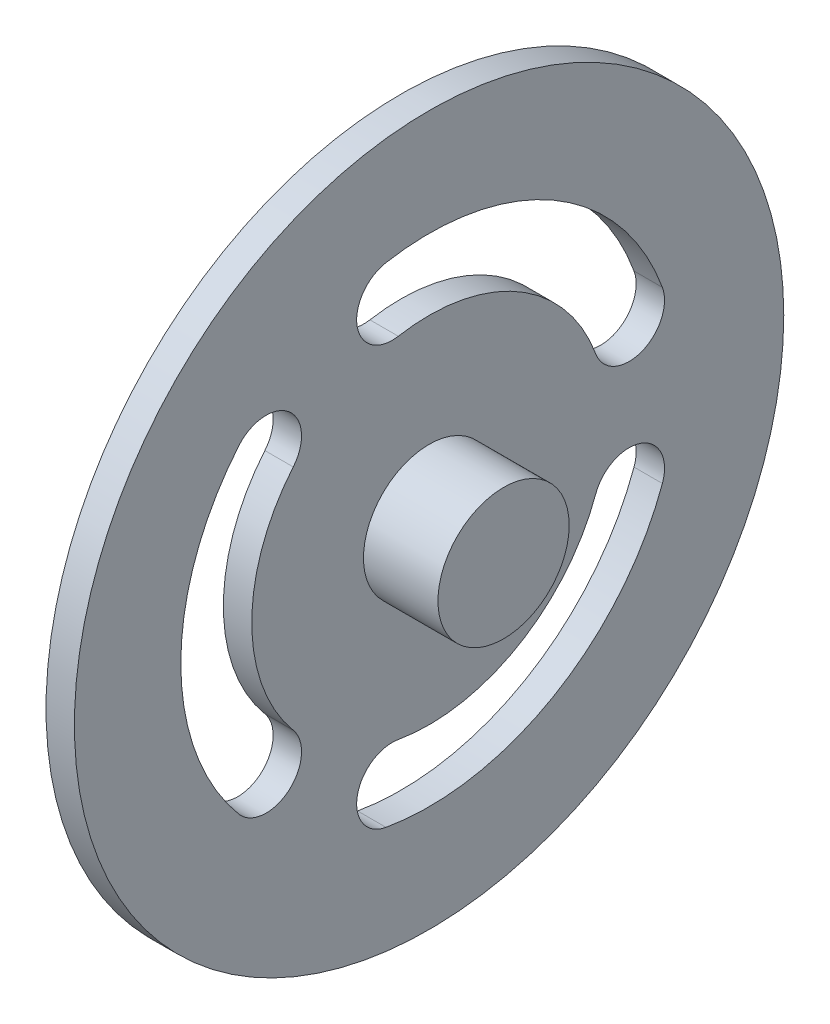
ISO-10303-21;
HEADER;
FILE_DESCRIPTION(('STEP AP214'),'2;1');
FILE_NAME('part.step','',(''),(''),'','','');
FILE_SCHEMA(('AUTOMOTIVE_DESIGN { 1 0 10303 214 1 1 1 1 }'));
ENDSEC;
DATA;
#1=APPLICATION_CONTEXT('core data for automotive mechanical design processes');
#2=APPLICATION_PROTOCOL_DEFINITION('international standard','automotive_design',2000,#1);
#3=PRODUCT_CONTEXT('',#1,'mechanical');
#4=PRODUCT('Part','Part','',(#3));
#5=PRODUCT_RELATED_PRODUCT_CATEGORY('part','',(#4));
#6=PRODUCT_DEFINITION_FORMATION('','',#4);
#7=PRODUCT_DEFINITION_CONTEXT('part definition',#1,'design');
#8=PRODUCT_DEFINITION('design','',#6,#7);
#9=PRODUCT_DEFINITION_SHAPE('','',#8);
#10=(LENGTH_UNIT() NAMED_UNIT(*) SI_UNIT(.MILLI.,.METRE.));
#11=(NAMED_UNIT(*) PLANE_ANGLE_UNIT() SI_UNIT($,.RADIAN.));
#12=(NAMED_UNIT(*) SI_UNIT($,.STERADIAN.) SOLID_ANGLE_UNIT());
#13=UNCERTAINTY_MEASURE_WITH_UNIT(LENGTH_MEASURE(1.E-05),#10,'distance_accuracy_value','');
#14=(GEOMETRIC_REPRESENTATION_CONTEXT(3) GLOBAL_UNCERTAINTY_ASSIGNED_CONTEXT((#13)) GLOBAL_UNIT_ASSIGNED_CONTEXT((#10,
#11,#12)) REPRESENTATION_CONTEXT('',''));
#15=CARTESIAN_POINT('',(0.,0.,0.));
#16=DIRECTION('',(0.,0.,1.));
#17=DIRECTION('',(1.,0.,0.));
#18=AXIS2_PLACEMENT_3D('',#15,#16,#17);
#19=CARTESIAN_POINT('',(-25.,0.,0.));
#20=DIRECTION('',(-1.,0.,0.));
#21=DIRECTION('',(0.,0.,1.));
#22=AXIS2_PLACEMENT_3D('',#19,#20,#21);
#23=PLANE('',#22);
#24=CARTESIAN_POINT('',(-25.,0.,0.));
#25=DIRECTION('',(1.,0.,0.));
#26=DIRECTION('',(0.,0.,-1.));
#27=AXIS2_PLACEMENT_3D('',#24,#25,#26);
#28=CIRCLE('',#27,18.5);
#29=CARTESIAN_POINT('',(-25.,0.,-18.5));
#30=VERTEX_POINT('',#29);
#31=EDGE_CURVE('E11',#30,#30,#28,.T.);
#32=ORIENTED_EDGE('',*,*,#31,.F.);
#33=EDGE_LOOP('',(#32));
#34=FACE_BOUND('',#33,.T.);
#35=ADVANCED_FACE('F34',(#34),#23,.T.);
#36=CARTESIAN_POINT('',(25.,0.,0.));
#37=DIRECTION('',(1.,0.,0.));
#38=DIRECTION('',(0.,0.,-1.));
#39=AXIS2_PLACEMENT_3D('',#36,#37,#38);
#40=CYLINDRICAL_SURFACE('',#39,18.5);
#41=ORIENTED_EDGE('',*,*,#31,.T.);
#42=EDGE_LOOP('',(#41));
#43=FACE_BOUND('',#42,.T.);
#44=CARTESIAN_POINT('',(-4.,0.,0.));
#45=DIRECTION('',(1.,0.,0.));
#46=DIRECTION('',(0.,0.,-1.));
#47=AXIS2_PLACEMENT_3D('',#44,#45,#46);
#48=CIRCLE('',#47,18.5);
#49=CARTESIAN_POINT('',(-4.,0.,-18.5));
#50=VERTEX_POINT('',#49);
#51=EDGE_CURVE('E41',#50,#50,#48,.T.);
#52=ORIENTED_EDGE('',*,*,#51,.F.);
#53=EDGE_LOOP('',(#52));
#54=FACE_BOUND('',#53,.T.);
#55=ADVANCED_FACE('F232',(#43,#54),#40,.T.);
#56=CARTESIAN_POINT('',(-4.,18.5,0.));
#57=DIRECTION('',(-1.,0.,0.));
#58=DIRECTION('',(0.,0.,1.));
#59=AXIS2_PLACEMENT_3D('',#56,#57,#58);
#60=PLANE('',#59);
#61=CARTESIAN_POINT('',(-4.,-59.0884651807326,10.4188906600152));
#62=DIRECTION('',(-1.,0.,0.));
#63=DIRECTION('',(0.,0.,1.));
#64=AXIS2_PLACEMENT_3D('',#61,#62,#63);
#65=CIRCLE('',#64,10.);
#66=CARTESIAN_POINT('',(-4.,-68.9365427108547,12.1553724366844));
#67=VERTEX_POINT('',#66);
#68=CARTESIAN_POINT('',(-4.,-49.2403876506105,8.68240888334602));
#69=VERTEX_POINT('',#68);
#70=EDGE_CURVE('E155',#67,#69,#65,.T.);
#71=ORIENTED_EDGE('',*,*,#70,.F.);
#72=CARTESIAN_POINT('',(-4.,0.,0.));
#73=DIRECTION('',(-1.,0.,0.));
#74=DIRECTION('',(0.,0.,1.));
#75=AXIS2_PLACEMENT_3D('',#72,#73,#74);
#76=CIRCLE('',#75,70.);
#77=CARTESIAN_POINT('',(-4.,-23.9414100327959,-65.7784834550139));
#78=VERTEX_POINT('',#77);
#79=EDGE_CURVE('E148',#78,#67,#76,.T.);
#80=ORIENTED_EDGE('',*,*,#79,.F.);
#81=CARTESIAN_POINT('',(-4.,-20.5212085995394,-56.3815572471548));
#82=DIRECTION('',(-1.,0.,0.));
#83=DIRECTION('',(0.,0.,1.));
#84=AXIS2_PLACEMENT_3D('',#81,#82,#83);
#85=CIRCLE('',#84,10.);
#86=CARTESIAN_POINT('',(-4.,-17.1010071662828,-46.9846310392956));
#87=VERTEX_POINT('',#86);
#88=EDGE_CURVE('E128',#87,#78,#85,.T.);
#89=ORIENTED_EDGE('',*,*,#88,.F.);
#90=CARTESIAN_POINT('',(-4.,0.,0.));
#91=DIRECTION('',(-1.,0.,0.));
#92=DIRECTION('',(0.,0.,1.));
#93=AXIS2_PLACEMENT_3D('',#90,#91,#92);
#94=CIRCLE('',#93,50.);
#95=EDGE_CURVE('E153',#69,#87,#94,.F.);
#96=ORIENTED_EDGE('',*,*,#95,.F.);
#97=EDGE_LOOP('',(#71,#80,#89,#96));
#98=FACE_BOUND('',#97,.T.);
#99=CARTESIAN_POINT('',(-4.,38.5672565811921,45.9626665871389));
#100=DIRECTION('',(-1.,0.,0.));
#101=DIRECTION('',(0.,0.,1.));
#102=AXIS2_PLACEMENT_3D('',#99,#100,#101);
#103=CIRCLE('',#102,10.);
#104=CARTESIAN_POINT('',(-4.,44.9951326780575,53.6231110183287));
#105=VERTEX_POINT('',#104);
#106=CARTESIAN_POINT('',(-4.,32.1393804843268,38.3022221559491));
#107=VERTEX_POINT('',#106);
#108=EDGE_CURVE('E184',#105,#107,#103,.T.);
#109=ORIENTED_EDGE('',*,*,#108,.F.);
#110=CARTESIAN_POINT('',(-4.,0.,0.));
#111=DIRECTION('',(-1.,0.,0.));
#112=DIRECTION('',(0.,0.,1.));
#113=AXIS2_PLACEMENT_3D('',#110,#111,#112);
#114=CIRCLE('',#113,70.);
#115=CARTESIAN_POINT('',(-4.,-44.9951326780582,53.6231110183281));
#116=VERTEX_POINT('',#115);
#117=EDGE_CURVE('E171',#116,#105,#114,.T.);
#118=ORIENTED_EDGE('',*,*,#117,.F.);
#119=CARTESIAN_POINT('',(-4.,-38.5672565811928,45.9626665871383));
#120=DIRECTION('',(-1.,0.,0.));
#121=DIRECTION('',(0.,0.,1.));
#122=AXIS2_PLACEMENT_3D('',#119,#120,#121);
#123=CIRCLE('',#122,10.);
#124=CARTESIAN_POINT('',(-4.,-32.1393804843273,38.3022221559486));
#125=VERTEX_POINT('',#124);
#126=EDGE_CURVE('E179',#125,#116,#123,.T.);
#127=ORIENTED_EDGE('',*,*,#126,.F.);
#128=CARTESIAN_POINT('',(-4.,0.,0.));
#129=DIRECTION('',(-1.,0.,0.));
#130=DIRECTION('',(0.,0.,1.));
#131=AXIS2_PLACEMENT_3D('',#128,#129,#130);
#132=CIRCLE('',#131,50.);
#133=EDGE_CURVE('E182',#107,#125,#132,.F.);
#134=ORIENTED_EDGE('',*,*,#133,.F.);
#135=EDGE_LOOP('',(#109,#118,#127,#134));
#136=FACE_BOUND('',#135,.T.);
#137=CARTESIAN_POINT('',(-4.,20.5212085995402,-56.3815572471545));
#138=DIRECTION('',(-1.,0.,0.));
#139=DIRECTION('',(0.,0.,1.));
#140=AXIS2_PLACEMENT_3D('',#137,#138,#139);
#141=CIRCLE('',#140,10.);
#142=CARTESIAN_POINT('',(-4.,23.9414100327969,-65.7784834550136));
#143=VERTEX_POINT('',#142);
#144=CARTESIAN_POINT('',(-4.,17.1010071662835,-46.9846310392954));
#145=VERTEX_POINT('',#144);
#146=EDGE_CURVE('E213',#143,#145,#141,.T.);
#147=ORIENTED_EDGE('',*,*,#146,.F.);
#148=CARTESIAN_POINT('',(-4.,0.,0.));
#149=DIRECTION('',(-1.,0.,0.));
#150=DIRECTION('',(0.,0.,1.));
#151=AXIS2_PLACEMENT_3D('',#148,#149,#150);
#152=CIRCLE('',#151,70.);
#153=CARTESIAN_POINT('',(-4.,68.9365427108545,12.1553724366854));
#154=VERTEX_POINT('',#153);
#155=EDGE_CURVE('E200',#154,#143,#152,.T.);
#156=ORIENTED_EDGE('',*,*,#155,.F.);
#157=CARTESIAN_POINT('',(-4.,59.0884651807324,10.4188906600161));
#158=DIRECTION('',(-1.,0.,0.));
#159=DIRECTION('',(0.,0.,1.));
#160=AXIS2_PLACEMENT_3D('',#157,#158,#159);
#161=CIRCLE('',#160,10.);
#162=CARTESIAN_POINT('',(-4.,49.2403876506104,8.68240888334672));
#163=VERTEX_POINT('',#162);
#164=EDGE_CURVE('E208',#163,#154,#161,.T.);
#165=ORIENTED_EDGE('',*,*,#164,.F.);
#166=CARTESIAN_POINT('',(-4.,0.,0.));
#167=DIRECTION('',(-1.,0.,0.));
#168=DIRECTION('',(0.,0.,1.));
#169=AXIS2_PLACEMENT_3D('',#166,#167,#168);
#170=CIRCLE('',#169,50.);
#171=EDGE_CURVE('E211',#145,#163,#170,.F.);
#172=ORIENTED_EDGE('',*,*,#171,.F.);
#173=EDGE_LOOP('',(#147,#156,#165,#172));
#174=FACE_BOUND('',#173,.T.);
#175=ORIENTED_EDGE('',*,*,#51,.T.);
#176=EDGE_LOOP('',(#175));
#177=FACE_BOUND('',#176,.T.);
#178=CARTESIAN_POINT('',(-4.,0.,0.));
#179=DIRECTION('',(1.,0.,0.));
#180=DIRECTION('',(0.,0.,-1.));
#181=AXIS2_PLACEMENT_3D('',#178,#179,#180);
#182=CIRCLE('',#181,100.);
#183=CARTESIAN_POINT('',(-4.,0.,-100.));
#184=VERTEX_POINT('',#183);
#185=EDGE_CURVE('E224',#184,#184,#182,.T.);
#186=ORIENTED_EDGE('',*,*,#185,.F.);
#187=EDGE_LOOP('',(#186));
#188=FACE_BOUND('',#187,.T.);
#189=ADVANCED_FACE('F229',(#98,#136,#174,#177,#188),#60,.T.);
#190=CARTESIAN_POINT('',(25.,0.,0.));
#191=DIRECTION('',(1.,0.,0.));
#192=DIRECTION('',(0.,0.,-1.));
#193=AXIS2_PLACEMENT_3D('',#190,#191,#192);
#194=CYLINDRICAL_SURFACE('',#193,100.);
#195=ORIENTED_EDGE('',*,*,#185,.T.);
#196=EDGE_LOOP('',(#195));
#197=FACE_BOUND('',#196,.T.);
#198=CARTESIAN_POINT('',(4.,0.,0.));
#199=DIRECTION('',(1.,0.,0.));
#200=DIRECTION('',(0.,0.,-1.));
#201=AXIS2_PLACEMENT_3D('',#198,#199,#200);
#202=CIRCLE('',#201,100.);
#203=CARTESIAN_POINT('',(4.,0.,-100.));
#204=VERTEX_POINT('',#203);
#205=EDGE_CURVE('E221',#204,#204,#202,.T.);
#206=ORIENTED_EDGE('',*,*,#205,.F.);
#207=EDGE_LOOP('',(#206));
#208=FACE_BOUND('',#207,.T.);
#209=ADVANCED_FACE('F239',(#197,#208),#194,.T.);
#210=CARTESIAN_POINT('',(4.,18.5,0.));
#211=DIRECTION('',(1.,0.,0.));
#212=DIRECTION('',(0.,0.,-1.));
#213=AXIS2_PLACEMENT_3D('',#210,#211,#212);
#214=PLANE('',#213);
#215=CARTESIAN_POINT('',(4.,-59.0884651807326,10.4188906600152));
#216=DIRECTION('',(1.,0.,0.));
#217=DIRECTION('',(0.,-0.866025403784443,0.499999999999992));
#218=AXIS2_PLACEMENT_3D('',#215,#216,#217);
#219=CIRCLE('',#218,10.);
#220=CARTESIAN_POINT('',(4.,-49.2403876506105,8.68240888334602));
#221=VERTEX_POINT('',#220);
#222=CARTESIAN_POINT('',(4.,-68.9365427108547,12.1553724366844));
#223=VERTEX_POINT('',#222);
#224=EDGE_CURVE('E56',#221,#223,#219,.T.);
#225=ORIENTED_EDGE('',*,*,#224,.F.);
#226=CARTESIAN_POINT('',(4.,0.,0.));
#227=DIRECTION('',(-1.,0.,0.));
#228=DIRECTION('',(0.,-0.866025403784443,0.499999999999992));
#229=AXIS2_PLACEMENT_3D('',#226,#227,#228);
#230=CIRCLE('',#229,50.);
#231=CARTESIAN_POINT('',(4.,-17.1010071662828,-46.9846310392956));
#232=VERTEX_POINT('',#231);
#233=EDGE_CURVE('E141',#232,#221,#230,.T.);
#234=ORIENTED_EDGE('',*,*,#233,.F.);
#235=CARTESIAN_POINT('',(4.,-20.5212085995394,-56.3815572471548));
#236=DIRECTION('',(1.,0.,0.));
#237=DIRECTION('',(0.,-0.866025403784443,0.499999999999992));
#238=AXIS2_PLACEMENT_3D('',#235,#236,#237);
#239=CIRCLE('',#238,10.);
#240=CARTESIAN_POINT('',(4.,-23.9414100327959,-65.7784834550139));
#241=VERTEX_POINT('',#240);
#242=EDGE_CURVE('E125',#241,#232,#239,.T.);
#243=ORIENTED_EDGE('',*,*,#242,.F.);
#244=CARTESIAN_POINT('',(4.,0.,0.));
#245=DIRECTION('',(1.,0.,0.));
#246=DIRECTION('',(0.,-0.866025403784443,0.499999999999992));
#247=AXIS2_PLACEMENT_3D('',#244,#245,#246);
#248=CIRCLE('',#247,70.);
#249=EDGE_CURVE('E134',#223,#241,#248,.T.);
#250=ORIENTED_EDGE('',*,*,#249,.F.);
#251=EDGE_LOOP('',(#225,#234,#243,#250));
#252=FACE_BOUND('',#251,.T.);
#253=CARTESIAN_POINT('',(4.,38.5672565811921,45.9626665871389));
#254=DIRECTION('',(1.,0.,0.));
#255=DIRECTION('',(0.,0.866025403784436,0.500000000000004));
#256=AXIS2_PLACEMENT_3D('',#253,#254,#255);
#257=CIRCLE('',#256,10.);
#258=CARTESIAN_POINT('',(4.,32.1393804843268,38.3022221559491));
#259=VERTEX_POINT('',#258);
#260=CARTESIAN_POINT('',(4.,44.9951326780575,53.6231110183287));
#261=VERTEX_POINT('',#260);
#262=EDGE_CURVE('E157',#259,#261,#257,.T.);
#263=ORIENTED_EDGE('',*,*,#262,.F.);
#264=CARTESIAN_POINT('',(4.,0.,0.));
#265=DIRECTION('',(-1.,0.,0.));
#266=DIRECTION('',(0.,0.866025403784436,0.500000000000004));
#267=AXIS2_PLACEMENT_3D('',#264,#265,#266);
#268=CIRCLE('',#267,50.);
#269=CARTESIAN_POINT('',(4.,-32.1393804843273,38.3022221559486));
#270=VERTEX_POINT('',#269);
#271=EDGE_CURVE('E165',#270,#259,#268,.T.);
#272=ORIENTED_EDGE('',*,*,#271,.F.);
#273=CARTESIAN_POINT('',(4.,-38.5672565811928,45.9626665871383));
#274=DIRECTION('',(1.,0.,0.));
#275=DIRECTION('',(0.,0.866025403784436,0.500000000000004));
#276=AXIS2_PLACEMENT_3D('',#273,#274,#275);
#277=CIRCLE('',#276,10.);
#278=CARTESIAN_POINT('',(4.,-44.9951326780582,53.6231110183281));
#279=VERTEX_POINT('',#278);
#280=EDGE_CURVE('E162',#279,#270,#277,.T.);
#281=ORIENTED_EDGE('',*,*,#280,.F.);
#282=CARTESIAN_POINT('',(4.,0.,0.));
#283=DIRECTION('',(1.,0.,0.));
#284=DIRECTION('',(0.,0.866025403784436,0.500000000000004));
#285=AXIS2_PLACEMENT_3D('',#282,#283,#284);
#286=CIRCLE('',#285,70.);
#287=EDGE_CURVE('E159',#261,#279,#286,.T.);
#288=ORIENTED_EDGE('',*,*,#287,.F.);
#289=EDGE_LOOP('',(#263,#272,#281,#288));
#290=FACE_BOUND('',#289,.T.);
#291=CARTESIAN_POINT('',(4.,20.5212085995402,-56.3815572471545));
#292=DIRECTION('',(1.,0.,0.));
#293=DIRECTION('',(0.,0.,-1.));
#294=AXIS2_PLACEMENT_3D('',#291,#292,#293);
#295=CIRCLE('',#294,10.);
#296=CARTESIAN_POINT('',(4.,17.1010071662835,-46.9846310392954));
#297=VERTEX_POINT('',#296);
#298=CARTESIAN_POINT('',(4.,23.9414100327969,-65.7784834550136));
#299=VERTEX_POINT('',#298);
#300=EDGE_CURVE('E186',#297,#299,#295,.T.);
#301=ORIENTED_EDGE('',*,*,#300,.F.);
#302=CARTESIAN_POINT('',(4.,0.,0.));
#303=DIRECTION('',(-1.,0.,0.));
#304=DIRECTION('',(0.,0.,-1.));
#305=AXIS2_PLACEMENT_3D('',#302,#303,#304);
#306=CIRCLE('',#305,50.);
#307=CARTESIAN_POINT('',(4.,49.2403876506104,8.68240888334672));
#308=VERTEX_POINT('',#307);
#309=EDGE_CURVE('E194',#308,#297,#306,.T.);
#310=ORIENTED_EDGE('',*,*,#309,.F.);
#311=CARTESIAN_POINT('',(4.,59.0884651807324,10.4188906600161));
#312=DIRECTION('',(1.,0.,0.));
#313=DIRECTION('',(0.,0.,-1.));
#314=AXIS2_PLACEMENT_3D('',#311,#312,#313);
#315=CIRCLE('',#314,10.);
#316=CARTESIAN_POINT('',(4.,68.9365427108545,12.1553724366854));
#317=VERTEX_POINT('',#316);
#318=EDGE_CURVE('E191',#317,#308,#315,.T.);
#319=ORIENTED_EDGE('',*,*,#318,.F.);
#320=CARTESIAN_POINT('',(4.,0.,0.));
#321=DIRECTION('',(1.,0.,0.));
#322=DIRECTION('',(0.,0.,-1.));
#323=AXIS2_PLACEMENT_3D('',#320,#321,#322);
#324=CIRCLE('',#323,70.);
#325=EDGE_CURVE('E188',#299,#317,#324,.T.);
#326=ORIENTED_EDGE('',*,*,#325,.F.);
#327=EDGE_LOOP('',(#301,#310,#319,#326));
#328=FACE_BOUND('',#327,.T.);
#329=ORIENTED_EDGE('',*,*,#205,.T.);
#330=EDGE_LOOP('',(#329));
#331=FACE_BOUND('',#330,.T.);
#332=CARTESIAN_POINT('',(4.,0.,0.));
#333=DIRECTION('',(1.,0.,0.));
#334=DIRECTION('',(0.,0.,-1.));
#335=AXIS2_PLACEMENT_3D('',#332,#333,#334);
#336=CIRCLE('',#335,18.5);
#337=CARTESIAN_POINT('',(4.,0.,-18.5));
#338=VERTEX_POINT('',#337);
#339=EDGE_CURVE('E218',#338,#338,#336,.T.);
#340=ORIENTED_EDGE('',*,*,#339,.F.);
#341=EDGE_LOOP('',(#340));
#342=FACE_BOUND('',#341,.T.);
#343=ADVANCED_FACE('F138',(#252,#290,#328,#331,#342),#214,.T.);
#344=CARTESIAN_POINT('',(25.,0.,0.));
#345=DIRECTION('',(1.,0.,0.));
#346=DIRECTION('',(0.,0.,-1.));
#347=AXIS2_PLACEMENT_3D('',#344,#345,#346);
#348=CYLINDRICAL_SURFACE('',#347,18.5);
#349=ORIENTED_EDGE('',*,*,#339,.T.);
#350=EDGE_LOOP('',(#349));
#351=FACE_BOUND('',#350,.T.);
#352=CARTESIAN_POINT('',(25.,0.,0.));
#353=DIRECTION('',(1.,0.,0.));
#354=DIRECTION('',(0.,0.,-1.));
#355=AXIS2_PLACEMENT_3D('',#352,#353,#354);
#356=CIRCLE('',#355,18.5);
#357=CARTESIAN_POINT('',(25.,0.,-18.5));
#358=VERTEX_POINT('',#357);
#359=EDGE_CURVE('E215',#358,#358,#356,.T.);
#360=ORIENTED_EDGE('',*,*,#359,.F.);
#361=EDGE_LOOP('',(#360));
#362=FACE_BOUND('',#361,.T.);
#363=ADVANCED_FACE('F249',(#351,#362),#348,.T.);
#364=CARTESIAN_POINT('',(25.,0.,0.));
#365=DIRECTION('',(1.,0.,0.));
#366=DIRECTION('',(0.,0.,-1.));
#367=AXIS2_PLACEMENT_3D('',#364,#365,#366);
#368=PLANE('',#367);
#369=ORIENTED_EDGE('',*,*,#359,.T.);
#370=EDGE_LOOP('',(#369));
#371=FACE_BOUND('',#370,.T.);
#372=ADVANCED_FACE('F252',(#371),#368,.T.);
#373=CARTESIAN_POINT('',(-25.,20.5212085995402,-56.3815572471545));
#374=DIRECTION('',(1.,0.,0.));
#375=DIRECTION('',(0.,0.,-1.));
#376=AXIS2_PLACEMENT_3D('',#373,#374,#375);
#377=CYLINDRICAL_SURFACE('',#376,10.);
#378=ORIENTED_EDGE('',*,*,#146,.T.);
#379=DIRECTION('',(1.,0.,0.));
#380=VECTOR('',#379,1.);
#381=CARTESIAN_POINT('',(-25.,17.1010071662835,-46.9846310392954));
#382=LINE('',#381,#380);
#383=EDGE_CURVE('E198',#145,#297,#382,.T.);
#384=ORIENTED_EDGE('',*,*,#383,.T.);
#385=ORIENTED_EDGE('',*,*,#300,.T.);
#386=DIRECTION('',(1.,0.,0.));
#387=VECTOR('',#386,1.);
#388=CARTESIAN_POINT('',(-25.,23.9414100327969,-65.7784834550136));
#389=LINE('',#388,#387);
#390=EDGE_CURVE('E197',#143,#299,#389,.T.);
#391=ORIENTED_EDGE('',*,*,#390,.F.);
#392=EDGE_LOOP('',(#378,#384,#385,#391));
#393=FACE_BOUND('',#392,.T.);
#394=ADVANCED_FACE('F256',(#393),#377,.F.);
#395=CARTESIAN_POINT('',(-25.,0.,0.));
#396=DIRECTION('',(1.,0.,0.));
#397=DIRECTION('',(0.,0.,-1.));
#398=AXIS2_PLACEMENT_3D('',#395,#396,#397);
#399=CYLINDRICAL_SURFACE('',#398,50.);
#400=ORIENTED_EDGE('',*,*,#171,.T.);
#401=DIRECTION('',(1.,0.,0.));
#402=VECTOR('',#401,1.);
#403=CARTESIAN_POINT('',(-25.,49.2403876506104,8.68240888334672));
#404=LINE('',#403,#402);
#405=EDGE_CURVE('E201',#163,#308,#404,.T.);
#406=ORIENTED_EDGE('',*,*,#405,.T.);
#407=ORIENTED_EDGE('',*,*,#309,.T.);
#408=ORIENTED_EDGE('',*,*,#383,.F.);
#409=EDGE_LOOP('',(#400,#406,#407,#408));
#410=FACE_BOUND('',#409,.T.);
#411=ADVANCED_FACE('F260',(#410),#399,.T.);
#412=CARTESIAN_POINT('',(-25.,59.0884651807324,10.4188906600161));
#413=DIRECTION('',(1.,0.,0.));
#414=DIRECTION('',(0.,0.,-1.));
#415=AXIS2_PLACEMENT_3D('',#412,#413,#414);
#416=CYLINDRICAL_SURFACE('',#415,10.);
#417=ORIENTED_EDGE('',*,*,#164,.T.);
#418=DIRECTION('',(1.,0.,0.));
#419=VECTOR('',#418,1.);
#420=CARTESIAN_POINT('',(-25.,68.9365427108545,12.1553724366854));
#421=LINE('',#420,#419);
#422=EDGE_CURVE('E203',#154,#317,#421,.T.);
#423=ORIENTED_EDGE('',*,*,#422,.T.);
#424=ORIENTED_EDGE('',*,*,#318,.T.);
#425=ORIENTED_EDGE('',*,*,#405,.F.);
#426=EDGE_LOOP('',(#417,#423,#424,#425));
#427=FACE_BOUND('',#426,.T.);
#428=ADVANCED_FACE('F266',(#427),#416,.F.);
#429=CARTESIAN_POINT('',(-25.,0.,0.));
#430=DIRECTION('',(1.,0.,0.));
#431=DIRECTION('',(0.,0.,-1.));
#432=AXIS2_PLACEMENT_3D('',#429,#430,#431);
#433=CYLINDRICAL_SURFACE('',#432,70.);
#434=ORIENTED_EDGE('',*,*,#155,.T.);
#435=ORIENTED_EDGE('',*,*,#390,.T.);
#436=ORIENTED_EDGE('',*,*,#325,.T.);
#437=ORIENTED_EDGE('',*,*,#422,.F.);
#438=EDGE_LOOP('',(#434,#435,#436,#437));
#439=FACE_BOUND('',#438,.T.);
#440=ADVANCED_FACE('F262',(#439),#433,.F.);
#441=CARTESIAN_POINT('',(-25.,38.5672565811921,45.9626665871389));
#442=DIRECTION('',(1.,0.,0.));
#443=DIRECTION('',(0.,0.,-1.));
#444=AXIS2_PLACEMENT_3D('',#441,#442,#443);
#445=CYLINDRICAL_SURFACE('',#444,10.);
#446=ORIENTED_EDGE('',*,*,#108,.T.);
#447=DIRECTION('',(1.,0.,0.));
#448=VECTOR('',#447,1.);
#449=CARTESIAN_POINT('',(-25.,32.1393804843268,38.3022221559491));
#450=LINE('',#449,#448);
#451=EDGE_CURVE('E169',#107,#259,#450,.T.);
#452=ORIENTED_EDGE('',*,*,#451,.T.);
#453=ORIENTED_EDGE('',*,*,#262,.T.);
#454=DIRECTION('',(1.,0.,0.));
#455=VECTOR('',#454,1.);
#456=CARTESIAN_POINT('',(-25.,44.9951326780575,53.6231110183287));
#457=LINE('',#456,#455);
#458=EDGE_CURVE('E168',#105,#261,#457,.T.);
#459=ORIENTED_EDGE('',*,*,#458,.F.);
#460=EDGE_LOOP('',(#446,#452,#453,#459));
#461=FACE_BOUND('',#460,.T.);
#462=ADVANCED_FACE('F265',(#461),#445,.F.);
#463=CARTESIAN_POINT('',(-25.,0.,0.));
#464=DIRECTION('',(1.,0.,0.));
#465=DIRECTION('',(0.,0.,-1.));
#466=AXIS2_PLACEMENT_3D('',#463,#464,#465);
#467=CYLINDRICAL_SURFACE('',#466,50.);
#468=ORIENTED_EDGE('',*,*,#133,.T.);
#469=DIRECTION('',(1.,0.,0.));
#470=VECTOR('',#469,1.);
#471=CARTESIAN_POINT('',(-25.,-32.1393804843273,38.3022221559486));
#472=LINE('',#471,#470);
#473=EDGE_CURVE('E172',#125,#270,#472,.T.);
#474=ORIENTED_EDGE('',*,*,#473,.T.);
#475=ORIENTED_EDGE('',*,*,#271,.T.);
#476=ORIENTED_EDGE('',*,*,#451,.F.);
#477=EDGE_LOOP('',(#468,#474,#475,#476));
#478=FACE_BOUND('',#477,.T.);
#479=ADVANCED_FACE('F276',(#478),#467,.T.);
#480=CARTESIAN_POINT('',(-25.,-38.5672565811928,45.9626665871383));
#481=DIRECTION('',(1.,0.,0.));
#482=DIRECTION('',(0.,0.,-1.));
#483=AXIS2_PLACEMENT_3D('',#480,#481,#482);
#484=CYLINDRICAL_SURFACE('',#483,10.);
#485=ORIENTED_EDGE('',*,*,#126,.T.);
#486=DIRECTION('',(1.,0.,0.));
#487=VECTOR('',#486,1.);
#488=CARTESIAN_POINT('',(-25.,-44.9951326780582,53.6231110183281));
#489=LINE('',#488,#487);
#490=EDGE_CURVE('E174',#116,#279,#489,.T.);
#491=ORIENTED_EDGE('',*,*,#490,.T.);
#492=ORIENTED_EDGE('',*,*,#280,.T.);
#493=ORIENTED_EDGE('',*,*,#473,.F.);
#494=EDGE_LOOP('',(#485,#491,#492,#493));
#495=FACE_BOUND('',#494,.T.);
#496=ADVANCED_FACE('F282',(#495),#484,.F.);
#497=CARTESIAN_POINT('',(-25.,0.,0.));
#498=DIRECTION('',(1.,0.,0.));
#499=DIRECTION('',(0.,0.,-1.));
#500=AXIS2_PLACEMENT_3D('',#497,#498,#499);
#501=CYLINDRICAL_SURFACE('',#500,70.);
#502=ORIENTED_EDGE('',*,*,#117,.T.);
#503=ORIENTED_EDGE('',*,*,#458,.T.);
#504=ORIENTED_EDGE('',*,*,#287,.T.);
#505=ORIENTED_EDGE('',*,*,#490,.F.);
#506=EDGE_LOOP('',(#502,#503,#504,#505));
#507=FACE_BOUND('',#506,.T.);
#508=ADVANCED_FACE('F278',(#507),#501,.F.);
#509=CARTESIAN_POINT('',(-25.,-59.0884651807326,10.4188906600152));
#510=DIRECTION('',(1.,0.,0.));
#511=DIRECTION('',(0.,0.,-1.));
#512=AXIS2_PLACEMENT_3D('',#509,#510,#511);
#513=CYLINDRICAL_SURFACE('',#512,10.);
#514=ORIENTED_EDGE('',*,*,#70,.T.);
#515=DIRECTION('',(1.,0.,0.));
#516=VECTOR('',#515,1.);
#517=CARTESIAN_POINT('',(-25.,-49.2403876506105,8.68240888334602));
#518=LINE('',#517,#516);
#519=EDGE_CURVE('E146',#69,#221,#518,.T.);
#520=ORIENTED_EDGE('',*,*,#519,.T.);
#521=ORIENTED_EDGE('',*,*,#224,.T.);
#522=DIRECTION('',(1.,0.,0.));
#523=VECTOR('',#522,1.);
#524=CARTESIAN_POINT('',(-25.,-68.9365427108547,12.1553724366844));
#525=LINE('',#524,#523);
#526=EDGE_CURVE('E131',#67,#223,#525,.T.);
#527=ORIENTED_EDGE('',*,*,#526,.F.);
#528=EDGE_LOOP('',(#514,#520,#521,#527));
#529=FACE_BOUND('',#528,.T.);
#530=ADVANCED_FACE('F281',(#529),#513,.F.);
#531=CARTESIAN_POINT('',(-25.,0.,0.));
#532=DIRECTION('',(1.,0.,0.));
#533=DIRECTION('',(0.,0.,-1.));
#534=AXIS2_PLACEMENT_3D('',#531,#532,#533);
#535=CYLINDRICAL_SURFACE('',#534,50.);
#536=ORIENTED_EDGE('',*,*,#95,.T.);
#537=DIRECTION('',(1.,0.,0.));
#538=VECTOR('',#537,1.);
#539=CARTESIAN_POINT('',(-25.,-17.1010071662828,-46.9846310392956));
#540=LINE('',#539,#538);
#541=EDGE_CURVE('E130',#87,#232,#540,.T.);
#542=ORIENTED_EDGE('',*,*,#541,.T.);
#543=ORIENTED_EDGE('',*,*,#233,.T.);
#544=ORIENTED_EDGE('',*,*,#519,.F.);
#545=EDGE_LOOP('',(#536,#542,#543,#544));
#546=FACE_BOUND('',#545,.T.);
#547=ADVANCED_FACE('F292',(#546),#535,.T.);
#548=CARTESIAN_POINT('',(-25.,-20.5212085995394,-56.3815572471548));
#549=DIRECTION('',(1.,0.,0.));
#550=DIRECTION('',(0.,0.,-1.));
#551=AXIS2_PLACEMENT_3D('',#548,#549,#550);
#552=CYLINDRICAL_SURFACE('',#551,10.);
#553=ORIENTED_EDGE('',*,*,#88,.T.);
#554=DIRECTION('',(1.,0.,0.));
#555=VECTOR('',#554,1.);
#556=CARTESIAN_POINT('',(-25.,-23.9414100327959,-65.7784834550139));
#557=LINE('',#556,#555);
#558=EDGE_CURVE('E48',#78,#241,#557,.T.);
#559=ORIENTED_EDGE('',*,*,#558,.T.);
#560=ORIENTED_EDGE('',*,*,#242,.T.);
#561=ORIENTED_EDGE('',*,*,#541,.F.);
#562=EDGE_LOOP('',(#553,#559,#560,#561));
#563=FACE_BOUND('',#562,.T.);
#564=ADVANCED_FACE('F122',(#563),#552,.F.);
#565=CARTESIAN_POINT('',(-25.,0.,0.));
#566=DIRECTION('',(1.,0.,0.));
#567=DIRECTION('',(0.,0.,-1.));
#568=AXIS2_PLACEMENT_3D('',#565,#566,#567);
#569=CYLINDRICAL_SURFACE('',#568,70.);
#570=ORIENTED_EDGE('',*,*,#79,.T.);
#571=ORIENTED_EDGE('',*,*,#526,.T.);
#572=ORIENTED_EDGE('',*,*,#249,.T.);
#573=ORIENTED_EDGE('',*,*,#558,.F.);
#574=EDGE_LOOP('',(#570,#571,#572,#573));
#575=FACE_BOUND('',#574,.T.);
#576=ADVANCED_FACE('F135',(#575),#569,.F.);
#577=CLOSED_SHELL('',(#35,#55,#189,#209,#343,#363,#372,#394,#411,#428,#440,#462,#479,#496,#508,
#530,#547,#564,#576));
#578=MANIFOLD_SOLID_BREP('B2',#577);
#579=ADVANCED_BREP_SHAPE_REPRESENTATION('',(#18,#578),#14);
#580=SHAPE_DEFINITION_REPRESENTATION(#9,#579);
ENDSEC;
END-ISO-10303-21;
